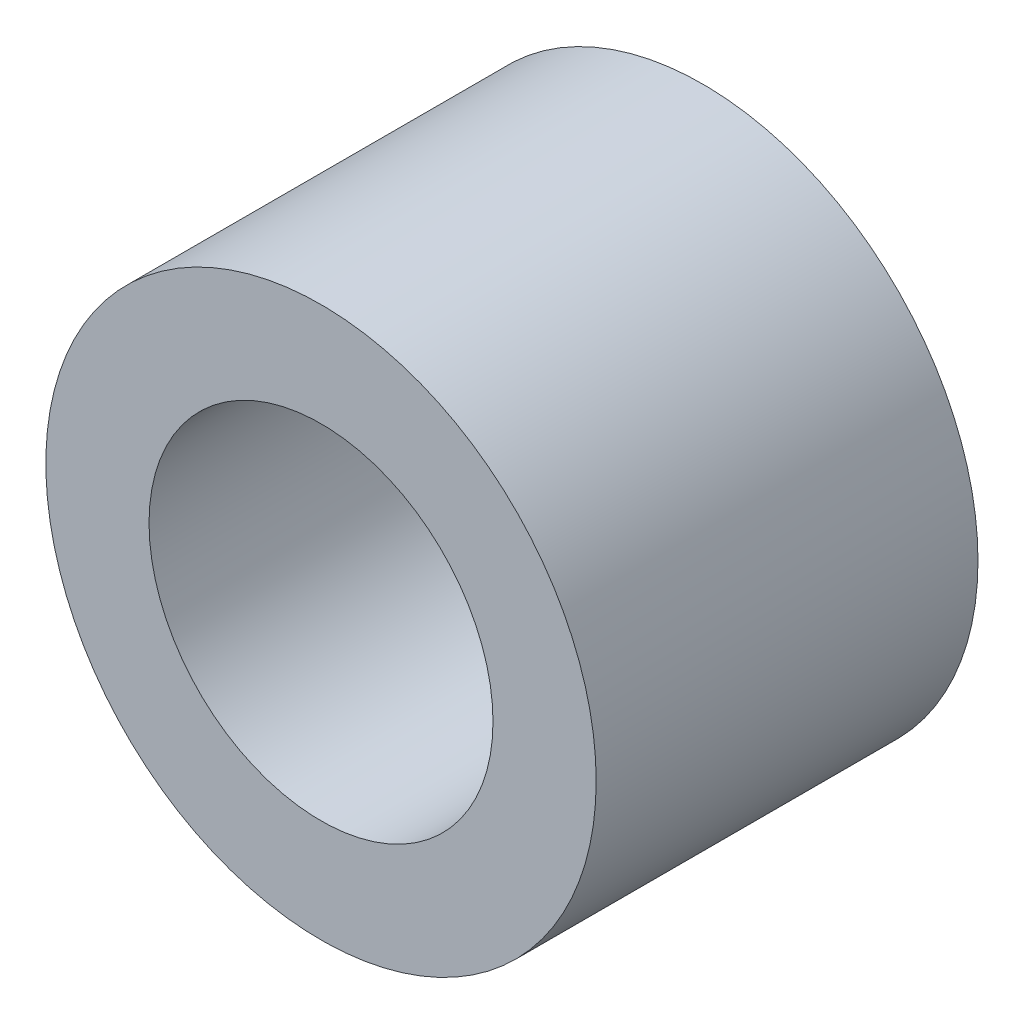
from build123d import *

# Parameters (mm, degrees)
SKETCH1_R           = 40
SKETCH1_R_2         = 25
BOSS_EXTRUDE1_DEPTH = 55.5


with BuildPart() as part:
    # Sketch1 → Boss-Extrude1 (new body)
    with BuildSketch(Plane.XY):
        Circle(SKETCH1_R)
        Circle(SKETCH1_R_2, mode=Mode.SUBTRACT)
    extrude(amount=BOSS_EXTRUDE1_DEPTH)


solid = part.part
